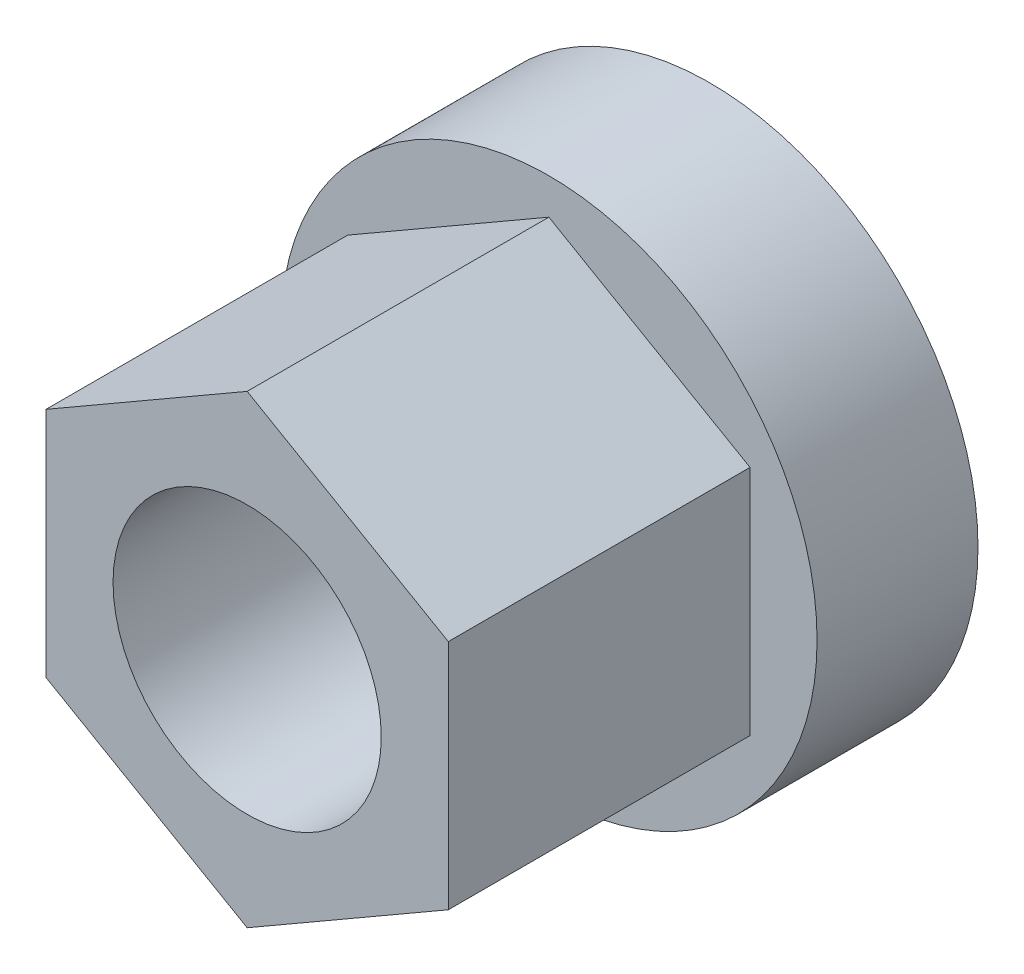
ISO-10303-21;
HEADER;
FILE_DESCRIPTION(('STEP AP214'),'2;1');
FILE_NAME('part.step','',(''),(''),'','','');
FILE_SCHEMA(('AUTOMOTIVE_DESIGN { 1 0 10303 214 1 1 1 1 }'));
ENDSEC;
DATA;
#1=APPLICATION_CONTEXT('core data for automotive mechanical design processes');
#2=APPLICATION_PROTOCOL_DEFINITION('international standard','automotive_design',2000,#1);
#3=PRODUCT_CONTEXT('',#1,'mechanical');
#4=PRODUCT('Part','Part','',(#3));
#5=PRODUCT_RELATED_PRODUCT_CATEGORY('part','',(#4));
#6=PRODUCT_DEFINITION_FORMATION('','',#4);
#7=PRODUCT_DEFINITION_CONTEXT('part definition',#1,'design');
#8=PRODUCT_DEFINITION('design','',#6,#7);
#9=PRODUCT_DEFINITION_SHAPE('','',#8);
#10=(LENGTH_UNIT() NAMED_UNIT(*) SI_UNIT(.MILLI.,.METRE.));
#11=(NAMED_UNIT(*) PLANE_ANGLE_UNIT() SI_UNIT($,.RADIAN.));
#12=(NAMED_UNIT(*) SI_UNIT($,.STERADIAN.) SOLID_ANGLE_UNIT());
#13=UNCERTAINTY_MEASURE_WITH_UNIT(LENGTH_MEASURE(1.E-05),#10,'distance_accuracy_value','');
#14=(GEOMETRIC_REPRESENTATION_CONTEXT(3) GLOBAL_UNCERTAINTY_ASSIGNED_CONTEXT((#13)) GLOBAL_UNIT_ASSIGNED_CONTEXT((#10,
#11,#12)) REPRESENTATION_CONTEXT('',''));
#15=CARTESIAN_POINT('',(0.,0.,0.));
#16=DIRECTION('',(0.,0.,1.));
#17=DIRECTION('',(1.,0.,0.));
#18=AXIS2_PLACEMENT_3D('',#15,#16,#17);
#19=CARTESIAN_POINT('',(-20.,0.,34.5));
#20=DIRECTION('',(0.,0.,-1.));
#21=DIRECTION('',(-1.,0.,0.));
#22=AXIS2_PLACEMENT_3D('',#19,#20,#21);
#23=PLANE('',#22);
#24=CARTESIAN_POINT('',(0.,0.,34.5));
#25=DIRECTION('',(0.,0.,1.));
#26=DIRECTION('',(1.,0.,0.));
#27=AXIS2_PLACEMENT_3D('',#24,#25,#26);
#28=CIRCLE('',#27,10.);
#29=CARTESIAN_POINT('',(10.,0.,34.5));
#30=VERTEX_POINT('',#29);
#31=EDGE_CURVE('E9',#30,#30,#28,.T.);
#32=ORIENTED_EDGE('',*,*,#31,.F.);
#33=EDGE_LOOP('',(#32));
#34=FACE_BOUND('',#33,.T.);
#35=DIRECTION('',(0.86602540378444,-0.5,0.));
#36=VECTOR('',#35,1.);
#37=CARTESIAN_POINT('',(-15.,-8.66025403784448,34.5));
#38=LINE('',#37,#36);
#39=CARTESIAN_POINT('',(-15.,-8.66025403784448,34.5));
#40=VERTEX_POINT('',#39);
#41=CARTESIAN_POINT('',(0.,-17.3205080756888,34.5));
#42=VERTEX_POINT('',#41);
#43=EDGE_CURVE('E87',#40,#42,#38,.T.);
#44=ORIENTED_EDGE('',*,*,#43,.T.);
#45=DIRECTION('',(0.866025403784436,0.5,0.));
#46=VECTOR('',#45,1.);
#47=CARTESIAN_POINT('',(0.,-17.3205080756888,34.5));
#48=LINE('',#47,#46);
#49=CARTESIAN_POINT('',(15.,-8.66025403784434,34.5));
#50=VERTEX_POINT('',#49);
#51=EDGE_CURVE('E85',#42,#50,#48,.T.);
#52=ORIENTED_EDGE('',*,*,#51,.T.);
#53=DIRECTION('',(0.,1.,0.));
#54=VECTOR('',#53,1.);
#55=CARTESIAN_POINT('',(15.,-8.66025403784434,34.5));
#56=LINE('',#55,#54);
#57=CARTESIAN_POINT('',(15.,8.66025403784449,34.5));
#58=VERTEX_POINT('',#57);
#59=EDGE_CURVE('E29',#50,#58,#56,.T.);
#60=ORIENTED_EDGE('',*,*,#59,.T.);
#61=DIRECTION('',(-0.866025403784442,0.5,0.));
#62=VECTOR('',#61,1.);
#63=CARTESIAN_POINT('',(15.,8.66025403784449,34.5));
#64=LINE('',#63,#62);
#65=CARTESIAN_POINT('',(0.,17.3205080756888,34.5));
#66=VERTEX_POINT('',#65);
#67=EDGE_CURVE('E75',#58,#66,#64,.T.);
#68=ORIENTED_EDGE('',*,*,#67,.T.);
#69=DIRECTION('',(-0.86602540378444,-0.5,0.));
#70=VECTOR('',#69,1.);
#71=CARTESIAN_POINT('',(0.,17.3205080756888,34.5));
#72=LINE('',#71,#70);
#73=CARTESIAN_POINT('',(-15.,8.66025403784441,34.5));
#74=VERTEX_POINT('',#73);
#75=EDGE_CURVE('E80',#66,#74,#72,.T.);
#76=ORIENTED_EDGE('',*,*,#75,.T.);
#77=DIRECTION('',(0.,-1.,0.));
#78=VECTOR('',#77,1.);
#79=CARTESIAN_POINT('',(-15.,8.66025403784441,34.5));
#80=LINE('',#79,#78);
#81=EDGE_CURVE('E108',#74,#40,#80,.T.);
#82=ORIENTED_EDGE('',*,*,#81,.T.);
#83=EDGE_LOOP('',(#44,#52,#60,#68,#76,#82));
#84=FACE_BOUND('',#83,.T.);
#85=ADVANCED_FACE('F14',(#34,#84),#23,.F.);
#86=CARTESIAN_POINT('',(0.,0.,20.));
#87=DIRECTION('',(0.,0.,1.));
#88=DIRECTION('',(1.,0.,0.));
#89=AXIS2_PLACEMENT_3D('',#86,#87,#88);
#90=CYLINDRICAL_SURFACE('',#89,20.);
#91=CARTESIAN_POINT('',(0.,0.,0.));
#92=DIRECTION('',(0.,0.,1.));
#93=DIRECTION('',(1.,0.,0.));
#94=AXIS2_PLACEMENT_3D('',#91,#92,#93);
#95=CIRCLE('',#94,20.);
#96=CARTESIAN_POINT('',(20.,0.,0.));
#97=VERTEX_POINT('',#96);
#98=EDGE_CURVE('E116',#97,#97,#95,.T.);
#99=ORIENTED_EDGE('',*,*,#98,.T.);
#100=EDGE_LOOP('',(#99));
#101=FACE_BOUND('',#100,.T.);
#102=CARTESIAN_POINT('',(0.,0.,12.));
#103=DIRECTION('',(0.,0.,1.));
#104=DIRECTION('',(1.,0.,0.));
#105=AXIS2_PLACEMENT_3D('',#102,#103,#104);
#106=CIRCLE('',#105,20.);
#107=CARTESIAN_POINT('',(20.,0.,12.));
#108=VERTEX_POINT('',#107);
#109=EDGE_CURVE('E17',#108,#108,#106,.T.);
#110=ORIENTED_EDGE('',*,*,#109,.F.);
#111=EDGE_LOOP('',(#110));
#112=FACE_BOUND('',#111,.T.);
#113=ADVANCED_FACE('F127',(#101,#112),#90,.T.);
#114=CARTESIAN_POINT('',(0.,0.,20.));
#115=DIRECTION('',(0.,0.,1.));
#116=DIRECTION('',(1.,0.,0.));
#117=AXIS2_PLACEMENT_3D('',#114,#115,#116);
#118=CYLINDRICAL_SURFACE('',#117,10.);
#119=CARTESIAN_POINT('',(0.,0.,0.));
#120=DIRECTION('',(0.,0.,1.));
#121=DIRECTION('',(1.,0.,0.));
#122=AXIS2_PLACEMENT_3D('',#119,#120,#121);
#123=CIRCLE('',#122,10.);
#124=CARTESIAN_POINT('',(10.,0.,0.));
#125=VERTEX_POINT('',#124);
#126=EDGE_CURVE('E22',#125,#125,#123,.T.);
#127=ORIENTED_EDGE('',*,*,#126,.F.);
#128=EDGE_LOOP('',(#127));
#129=FACE_BOUND('',#128,.T.);
#130=ORIENTED_EDGE('',*,*,#31,.T.);
#131=EDGE_LOOP('',(#130));
#132=FACE_BOUND('',#131,.T.);
#133=ADVANCED_FACE('F124',(#129,#132),#118,.F.);
#134=CARTESIAN_POINT('',(-10.,0.,0.));
#135=DIRECTION('',(0.,0.,1.));
#136=DIRECTION('',(1.,0.,0.));
#137=AXIS2_PLACEMENT_3D('',#134,#135,#136);
#138=PLANE('',#137);
#139=ORIENTED_EDGE('',*,*,#98,.F.);
#140=EDGE_LOOP('',(#139));
#141=FACE_BOUND('',#140,.T.);
#142=ORIENTED_EDGE('',*,*,#126,.T.);
#143=EDGE_LOOP('',(#142));
#144=FACE_BOUND('',#143,.T.);
#145=ADVANCED_FACE('F122',(#141,#144),#138,.F.);
#146=CARTESIAN_POINT('',(0.,0.,12.));
#147=DIRECTION('',(0.,0.,1.));
#148=DIRECTION('',(1.,0.,0.));
#149=AXIS2_PLACEMENT_3D('',#146,#147,#148);
#150=PLANE('',#149);
#151=DIRECTION('',(0.,-1.,0.));
#152=VECTOR('',#151,1.);
#153=CARTESIAN_POINT('',(-15.,8.66025403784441,12.));
#154=LINE('',#153,#152);
#155=CARTESIAN_POINT('',(-15.,8.66025403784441,12.));
#156=VERTEX_POINT('',#155);
#157=CARTESIAN_POINT('',(-15.,-8.66025403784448,12.));
#158=VERTEX_POINT('',#157);
#159=EDGE_CURVE('E92',#156,#158,#154,.T.);
#160=ORIENTED_EDGE('',*,*,#159,.F.);
#161=DIRECTION('',(-0.86602540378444,-0.5,0.));
#162=VECTOR('',#161,1.);
#163=CARTESIAN_POINT('',(0.,17.3205080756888,12.));
#164=LINE('',#163,#162);
#165=CARTESIAN_POINT('',(0.,17.3205080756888,12.));
#166=VERTEX_POINT('',#165);
#167=EDGE_CURVE('E96',#166,#156,#164,.T.);
#168=ORIENTED_EDGE('',*,*,#167,.F.);
#169=DIRECTION('',(-0.866025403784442,0.5,0.));
#170=VECTOR('',#169,1.);
#171=CARTESIAN_POINT('',(15.,8.66025403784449,12.));
#172=LINE('',#171,#170);
#173=CARTESIAN_POINT('',(15.,8.66025403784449,12.));
#174=VERTEX_POINT('',#173);
#175=EDGE_CURVE('E99',#174,#166,#172,.T.);
#176=ORIENTED_EDGE('',*,*,#175,.F.);
#177=DIRECTION('',(0.,1.,0.));
#178=VECTOR('',#177,1.);
#179=CARTESIAN_POINT('',(15.,-8.66025403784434,12.));
#180=LINE('',#179,#178);
#181=CARTESIAN_POINT('',(15.,-8.66025403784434,12.));
#182=VERTEX_POINT('',#181);
#183=EDGE_CURVE('E37',#182,#174,#180,.T.);
#184=ORIENTED_EDGE('',*,*,#183,.F.);
#185=DIRECTION('',(0.866025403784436,0.5,0.));
#186=VECTOR('',#185,1.);
#187=CARTESIAN_POINT('',(0.,-17.3205080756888,12.));
#188=LINE('',#187,#186);
#189=CARTESIAN_POINT('',(0.,-17.3205080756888,12.));
#190=VERTEX_POINT('',#189);
#191=EDGE_CURVE('E102',#190,#182,#188,.T.);
#192=ORIENTED_EDGE('',*,*,#191,.F.);
#193=DIRECTION('',(0.86602540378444,-0.5,0.));
#194=VECTOR('',#193,1.);
#195=CARTESIAN_POINT('',(-15.,-8.66025403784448,12.));
#196=LINE('',#195,#194);
#197=EDGE_CURVE('E105',#158,#190,#196,.T.);
#198=ORIENTED_EDGE('',*,*,#197,.F.);
#199=EDGE_LOOP('',(#160,#168,#176,#184,#192,#198));
#200=FACE_BOUND('',#199,.T.);
#201=ORIENTED_EDGE('',*,*,#109,.T.);
#202=EDGE_LOOP('',(#201));
#203=FACE_BOUND('',#202,.T.);
#204=ADVANCED_FACE('F144',(#200,#203),#150,.T.);
#205=CARTESIAN_POINT('',(-15.,-8.66025403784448,12.));
#206=DIRECTION('',(-0.5,-0.86602540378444,0.));
#207=DIRECTION('',(0.86602540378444,-0.5,0.));
#208=AXIS2_PLACEMENT_3D('',#205,#206,#207);
#209=PLANE('',#208);
#210=DIRECTION('',(0.,0.,1.));
#211=VECTOR('',#210,1.);
#212=CARTESIAN_POINT('',(-15.,-8.66025403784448,12.));
#213=LINE('',#212,#211);
#214=EDGE_CURVE('E114',#158,#40,#213,.T.);
#215=ORIENTED_EDGE('',*,*,#214,.F.);
#216=ORIENTED_EDGE('',*,*,#197,.T.);
#217=DIRECTION('',(0.,0.,1.));
#218=VECTOR('',#217,1.);
#219=CARTESIAN_POINT('',(0.,-17.3205080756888,12.));
#220=LINE('',#219,#218);
#221=EDGE_CURVE('E95',#190,#42,#220,.T.);
#222=ORIENTED_EDGE('',*,*,#221,.T.);
#223=ORIENTED_EDGE('',*,*,#43,.F.);
#224=EDGE_LOOP('',(#215,#216,#222,#223));
#225=FACE_BOUND('',#224,.T.);
#226=ADVANCED_FACE('F152',(#225),#209,.T.);
#227=CARTESIAN_POINT('',(-15.,8.66025403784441,12.));
#228=DIRECTION('',(-1.,0.,0.));
#229=DIRECTION('',(0.,0.,1.));
#230=AXIS2_PLACEMENT_3D('',#227,#228,#229);
#231=PLANE('',#230);
#232=DIRECTION('',(0.,0.,1.));
#233=VECTOR('',#232,1.);
#234=CARTESIAN_POINT('',(-15.,8.66025403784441,12.));
#235=LINE('',#234,#233);
#236=EDGE_CURVE('E112',#156,#74,#235,.T.);
#237=ORIENTED_EDGE('',*,*,#236,.F.);
#238=ORIENTED_EDGE('',*,*,#159,.T.);
#239=ORIENTED_EDGE('',*,*,#214,.T.);
#240=ORIENTED_EDGE('',*,*,#81,.F.);
#241=EDGE_LOOP('',(#237,#238,#239,#240));
#242=FACE_BOUND('',#241,.T.);
#243=ADVANCED_FACE('F158',(#242),#231,.T.);
#244=CARTESIAN_POINT('',(0.,17.3205080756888,12.));
#245=DIRECTION('',(-0.5,0.86602540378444,0.));
#246=DIRECTION('',(-0.86602540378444,-0.5,0.));
#247=AXIS2_PLACEMENT_3D('',#244,#245,#246);
#248=PLANE('',#247);
#249=DIRECTION('',(0.,0.,1.));
#250=VECTOR('',#249,1.);
#251=CARTESIAN_POINT('',(0.,17.3205080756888,12.));
#252=LINE('',#251,#250);
#253=EDGE_CURVE('E71',#166,#66,#252,.T.);
#254=ORIENTED_EDGE('',*,*,#253,.F.);
#255=ORIENTED_EDGE('',*,*,#167,.T.);
#256=ORIENTED_EDGE('',*,*,#236,.T.);
#257=ORIENTED_EDGE('',*,*,#75,.F.);
#258=EDGE_LOOP('',(#254,#255,#256,#257));
#259=FACE_BOUND('',#258,.T.);
#260=ADVANCED_FACE('F169',(#259),#248,.T.);
#261=CARTESIAN_POINT('',(15.,8.66025403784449,12.));
#262=DIRECTION('',(0.5,0.866025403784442,0.));
#263=DIRECTION('',(-0.866025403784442,0.5,0.));
#264=AXIS2_PLACEMENT_3D('',#261,#262,#263);
#265=PLANE('',#264);
#266=DIRECTION('',(0.,0.,1.));
#267=VECTOR('',#266,1.);
#268=CARTESIAN_POINT('',(15.,8.66025403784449,12.));
#269=LINE('',#268,#267);
#270=EDGE_CURVE('E66',#174,#58,#269,.T.);
#271=ORIENTED_EDGE('',*,*,#270,.F.);
#272=ORIENTED_EDGE('',*,*,#175,.T.);
#273=ORIENTED_EDGE('',*,*,#253,.T.);
#274=ORIENTED_EDGE('',*,*,#67,.F.);
#275=EDGE_LOOP('',(#271,#272,#273,#274));
#276=FACE_BOUND('',#275,.T.);
#277=ADVANCED_FACE('F76',(#276),#265,.T.);
#278=CARTESIAN_POINT('',(15.,-8.66025403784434,12.));
#279=DIRECTION('',(1.,0.,0.));
#280=DIRECTION('',(0.,1.,0.));
#281=AXIS2_PLACEMENT_3D('',#278,#279,#280);
#282=PLANE('',#281);
#283=DIRECTION('',(0.,0.,1.));
#284=VECTOR('',#283,1.);
#285=CARTESIAN_POINT('',(15.,-8.66025403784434,12.));
#286=LINE('',#285,#284);
#287=EDGE_CURVE('E72',#182,#50,#286,.T.);
#288=ORIENTED_EDGE('',*,*,#287,.F.);
#289=ORIENTED_EDGE('',*,*,#183,.T.);
#290=ORIENTED_EDGE('',*,*,#270,.T.);
#291=ORIENTED_EDGE('',*,*,#59,.F.);
#292=EDGE_LOOP('',(#288,#289,#290,#291));
#293=FACE_BOUND('',#292,.T.);
#294=ADVANCED_FACE('F68',(#293),#282,.T.);
#295=CARTESIAN_POINT('',(0.,-17.3205080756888,12.));
#296=DIRECTION('',(0.5,-0.866025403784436,0.));
#297=DIRECTION('',(0.866025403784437,0.5,0.));
#298=AXIS2_PLACEMENT_3D('',#295,#296,#297);
#299=PLANE('',#298);
#300=ORIENTED_EDGE('',*,*,#191,.T.);
#301=ORIENTED_EDGE('',*,*,#287,.T.);
#302=ORIENTED_EDGE('',*,*,#51,.F.);
#303=ORIENTED_EDGE('',*,*,#221,.F.);
#304=EDGE_LOOP('',(#300,#301,#302,#303));
#305=FACE_BOUND('',#304,.T.);
#306=ADVANCED_FACE('F175',(#305),#299,.T.);
#307=CLOSED_SHELL('',(#85,#113,#133,#145,#204,#226,#243,#260,#277,#294,#306));
#308=MANIFOLD_SOLID_BREP('B1',#307);
#309=ADVANCED_BREP_SHAPE_REPRESENTATION('',(#18,#308),#14);
#310=SHAPE_DEFINITION_REPRESENTATION(#9,#309);
ENDSEC;
END-ISO-10303-21;
